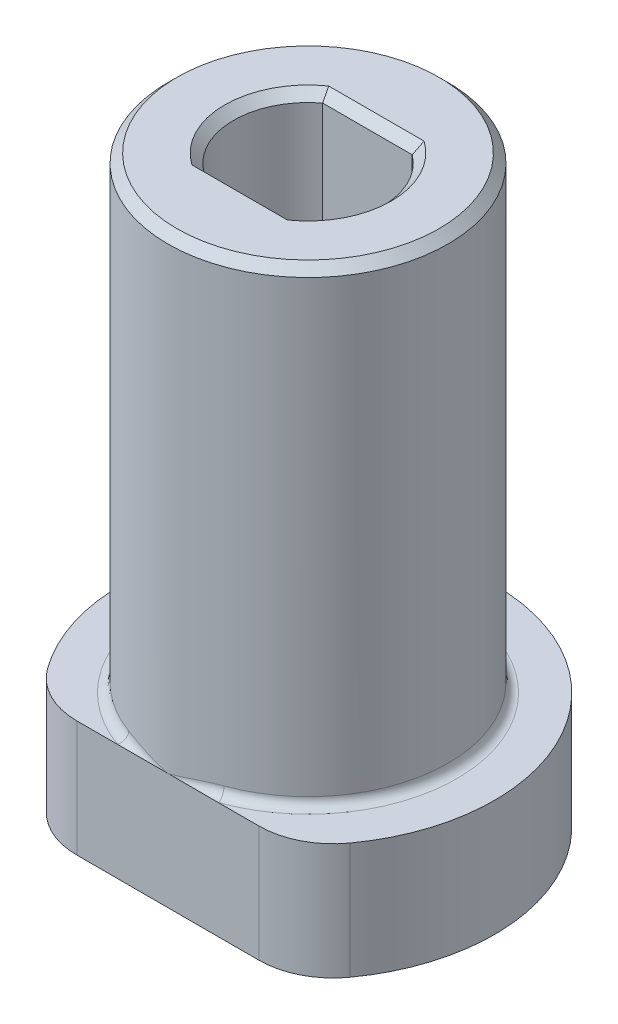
ISO-10303-21;
HEADER;
FILE_DESCRIPTION(('STEP AP214'),'2;1');
FILE_NAME('part.step','',(''),(''),'','','');
FILE_SCHEMA(('AUTOMOTIVE_DESIGN { 1 0 10303 214 1 1 1 1 }'));
ENDSEC;
DATA;
#1=APPLICATION_CONTEXT('core data for automotive mechanical design processes');
#2=APPLICATION_PROTOCOL_DEFINITION('international standard','automotive_design',2000,#1);
#3=PRODUCT_CONTEXT('',#1,'mechanical');
#4=PRODUCT('Part','Part','',(#3));
#5=PRODUCT_RELATED_PRODUCT_CATEGORY('part','',(#4));
#6=PRODUCT_DEFINITION_FORMATION('','',#4);
#7=PRODUCT_DEFINITION_CONTEXT('part definition',#1,'design');
#8=PRODUCT_DEFINITION('design','',#6,#7);
#9=PRODUCT_DEFINITION_SHAPE('','',#8);
#10=(LENGTH_UNIT() NAMED_UNIT(*) SI_UNIT(.MILLI.,.METRE.));
#11=(NAMED_UNIT(*) PLANE_ANGLE_UNIT() SI_UNIT($,.RADIAN.));
#12=(NAMED_UNIT(*) SI_UNIT($,.STERADIAN.) SOLID_ANGLE_UNIT());
#13=UNCERTAINTY_MEASURE_WITH_UNIT(LENGTH_MEASURE(1.E-05),#10,'distance_accuracy_value','');
#14=(GEOMETRIC_REPRESENTATION_CONTEXT(3) GLOBAL_UNCERTAINTY_ASSIGNED_CONTEXT((#13)) GLOBAL_UNIT_ASSIGNED_CONTEXT((#10,
#11,#12)) REPRESENTATION_CONTEXT('',''));
#15=CARTESIAN_POINT('',(0.,0.,0.));
#16=DIRECTION('',(0.,0.,1.));
#17=DIRECTION('',(1.,0.,0.));
#18=AXIS2_PLACEMENT_3D('',#15,#16,#17);
#19=CARTESIAN_POINT('',(0.,24.9936,0.));
#20=DIRECTION('',(0.,-1.,0.));
#21=DIRECTION('',(0.,0.,-1.));
#22=AXIS2_PLACEMENT_3D('',#19,#20,#21);
#23=CYLINDRICAL_SURFACE('',#22,5.99567);
#24=CARTESIAN_POINT('',(0.,24.6126,0.));
#25=DIRECTION('',(0.,1.,0.));
#26=DIRECTION('',(0.,0.,1.));
#27=AXIS2_PLACEMENT_3D('',#24,#25,#26);
#28=CIRCLE('',#27,5.99567);
#29=CARTESIAN_POINT('',(0.,24.6126,5.99567));
#30=VERTEX_POINT('',#29);
#31=EDGE_CURVE('E12',#30,#30,#28,.F.);
#32=ORIENTED_EDGE('',*,*,#31,.T.);
#33=EDGE_LOOP('',(#32));
#34=FACE_BOUND('',#33,.T.);
#35=CARTESIAN_POINT('',(-2.54980318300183,5.28632587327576,5.42646869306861));
#36=CARTESIAN_POINT('',(-2.48955629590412,5.07151106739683,5.4547776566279));
#37=CARTESIAN_POINT('',(-2.54417708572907,4.96770798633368,5.64665776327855));
#38=CARTESIAN_POINT('',(-2.59879787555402,4.86390490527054,5.8385378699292));
#39=CARTESIAN_POINT('',(-2.71183261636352,4.9784,5.99567));
#40=CARTESIAN_POINT('',(-2.5328324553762,5.29249967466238,5.43444335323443));
#41=CARTESIAN_POINT('',(-2.47686708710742,5.07926238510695,5.46051204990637));
#42=CARTESIAN_POINT('',(-2.53071149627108,4.97410558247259,5.64842878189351));
#43=CARTESIAN_POINT('',(-2.58464892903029,4.86890599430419,5.83633151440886));
#44=CARTESIAN_POINT('',(-2.69378346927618,4.9784,5.99567));
#45=CARTESIAN_POINT('',(-2.51569041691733,5.29813682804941,5.44240047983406));
#46=CARTESIAN_POINT('',(-2.46357302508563,5.08665837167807,5.46647827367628));
#47=CARTESIAN_POINT('',(-2.51670710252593,4.98030571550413,5.65053281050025));
#48=CARTESIAN_POINT('',(-2.56993249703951,4.8739154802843,5.83457198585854));
#49=CARTESIAN_POINT('',(-2.67555212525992,4.9784,5.99567));
#50=CARTESIAN_POINT('',(-2.48113264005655,5.30845859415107,5.45824144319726));
#51=CARTESIAN_POINT('',(-2.43607242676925,5.100688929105,5.47871075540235));
#52=CARTESIAN_POINT('',(-2.48782417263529,4.99226856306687,5.65527019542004));
#53=CARTESIAN_POINT('',(-2.53966544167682,4.88381087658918,5.83181533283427));
#54=CARTESIAN_POINT('',(-2.6387983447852,4.9784,5.99567));
#55=CARTESIAN_POINT('',(-2.46371706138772,5.31314374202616,5.46612531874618));
#56=CARTESIAN_POINT('',(-2.42186664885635,5.10733143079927,5.48497739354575));
#57=CARTESIAN_POINT('',(-2.47294613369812,4.99803152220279,5.65790325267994));
#58=CARTESIAN_POINT('',(-2.5241145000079,4.88869957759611,5.8308124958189));
#59=CARTESIAN_POINT('',(-2.62027607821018,4.9784,5.99567));
#60=CARTESIAN_POINT('',(-2.41122128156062,5.32594031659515,5.48958438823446));
#61=CARTESIAN_POINT('',(-2.3783667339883,5.12606545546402,5.50396956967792));
#62=CARTESIAN_POINT('',(-2.42735814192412,5.01458404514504,5.66638077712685));
#63=CARTESIAN_POINT('',(-2.47670012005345,4.90297487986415,5.82872696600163));
#64=CARTESIAN_POINT('',(-2.56444440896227,4.9784,5.99567));
#65=CARTESIAN_POINT('',(-2.37580723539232,5.33282227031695,5.50500692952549));
#66=CARTESIAN_POINT('',(-2.34786612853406,5.13714882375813,5.51703440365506));
#67=CARTESIAN_POINT('',(-2.39562554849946,5.02466938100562,5.67281373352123));
#68=CARTESIAN_POINT('',(-2.44371625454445,4.91209679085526,5.82852360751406));
#69=CARTESIAN_POINT('',(-2.52677994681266,4.9784,5.99567));
#70=CARTESIAN_POINT('',(-2.3046909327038,5.34393123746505,5.53515484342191));
#71=CARTESIAN_POINT('',(-2.28523912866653,5.15660519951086,5.5432215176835));
#72=CARTESIAN_POINT('',(-2.33063959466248,5.04291464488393,5.68651191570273));
#73=CARTESIAN_POINT('',(-2.37636397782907,4.92913328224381,5.82973366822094));
#74=CARTESIAN_POINT('',(-2.45114449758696,4.9784,5.99567));
#75=CARTESIAN_POINT('',(-2.26899348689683,5.34817975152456,5.54988492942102));
#76=CARTESIAN_POINT('',(-2.25311326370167,5.16503612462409,5.55635481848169));
#77=CARTESIAN_POINT('',(-2.29740099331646,5.0510898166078,5.69376981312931));
#78=CARTESIAN_POINT('',(-2.34198956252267,4.93707751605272,5.83111843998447));
#79=CARTESIAN_POINT('',(-2.41317862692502,4.9784,5.99567));
#80=CARTESIAN_POINT('',(-2.19715327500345,5.35457227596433,5.57871642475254));
#81=CARTESIAN_POINT('',(-2.18751899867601,5.17966637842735,5.58248690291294));
#82=CARTESIAN_POINT('',(-2.22964656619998,5.06578154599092,5.70876275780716));
#83=CARTESIAN_POINT('',(-2.27207244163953,4.95183278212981,5.83497240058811));
#84=CARTESIAN_POINT('',(-2.33677326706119,4.9784,5.99567));
#85=CARTESIAN_POINT('',(-2.16101016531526,5.35671454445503,5.59281730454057));
#86=CARTESIAN_POINT('',(-2.15402920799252,5.18589061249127,5.5954995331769));
#87=CARTESIAN_POINT('',(-2.19512970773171,5.07229672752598,5.71649819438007));
#88=CARTESIAN_POINT('',(-2.23650484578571,4.95866004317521,5.83743484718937));
#89=CARTESIAN_POINT('',(-2.29833341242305,4.9784,5.99567));
#90=CARTESIAN_POINT('',(-2.04046740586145,5.36092875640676,5.63849773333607));
#91=CARTESIAN_POINT('',(-2.04181783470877,5.20326472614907,5.63790197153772));
#92=CARTESIAN_POINT('',(-2.07900805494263,5.0914555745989,5.74248386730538));
#93=CARTESIAN_POINT('',(-2.11766521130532,4.97939863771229,5.84673875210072));
#94=CARTESIAN_POINT('',(-2.17013065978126,4.9784,5.99567));
#95=CARTESIAN_POINT('',(-1.9553715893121,5.35917193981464,5.66856856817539));
#96=CARTESIAN_POINT('',(-1.96023898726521,5.2104399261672,5.66685144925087));
#97=CARTESIAN_POINT('',(-1.99541430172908,5.10083051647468,5.7611298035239));
#98=CARTESIAN_POINT('',(-2.03179053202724,4.99112639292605,5.85515357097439));
#99=CARTESIAN_POINT('',(-2.07962735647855,4.9784,5.99567));
#100=CARTESIAN_POINT('',(-1.78423205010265,5.34914327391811,5.72474524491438));
#101=CARTESIAN_POINT('',(-1.79446551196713,5.21723388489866,5.72150414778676));
#102=CARTESIAN_POINT('',(-1.82561253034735,5.11346703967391,5.79744405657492));
#103=CARTESIAN_POINT('',(-1.85794408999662,5.00961731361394,5.87312842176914));
#104=CARTESIAN_POINT('',(-1.89761260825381,4.9784,5.99567));
#105=CARTESIAN_POINT('',(-1.69818768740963,5.34086672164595,5.75084820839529));
#106=CARTESIAN_POINT('',(-1.71004175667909,5.21696289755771,5.74733698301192));
#107=CARTESIAN_POINT('',(-1.73940266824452,5.11672420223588,5.81511165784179));
#108=CARTESIAN_POINT('',(-1.76972353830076,5.0164752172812,5.8827019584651));
#109=CARTESIAN_POINT('',(-1.80610048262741,4.9784,5.99567));
#110=CARTESIAN_POINT('',(-1.52486291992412,5.3194781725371,5.79922452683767));
#111=CARTESIAN_POINT('',(-1.53899766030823,5.21085838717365,5.79548128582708));
#112=CARTESIAN_POINT('',(-1.56472719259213,5.11858987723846,5.8486920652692));
#113=CARTESIAN_POINT('',(-1.59141922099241,5.02631112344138,5.90171763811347));
#114=CARTESIAN_POINT('',(-1.62176164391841,4.9784,5.99567));
#115=CARTESIAN_POINT('',(-1.43757808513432,5.30633034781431,5.82146766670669));
#116=CARTESIAN_POINT('',(-1.45215982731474,5.20503639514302,5.81786853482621));
#117=CARTESIAN_POINT('',(-1.47624950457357,5.11716331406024,5.86459070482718));
#118=CARTESIAN_POINT('',(-1.50110723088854,5.02931572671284,5.9111852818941));
#119=CARTESIAN_POINT('',(-1.52893021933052,4.9784,5.99567));
#120=CARTESIAN_POINT('',(-1.26259961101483,5.27647534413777,5.86190836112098));
#121=CARTESIAN_POINT('',(-1.27748293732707,5.1892434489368,5.85869577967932));
#122=CARTESIAN_POINT('',(-1.2982326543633,5.11072673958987,5.89397088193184));
#123=CARTESIAN_POINT('',(-1.31974036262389,5.03223969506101,5.9291217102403));
#124=CARTESIAN_POINT('',(-1.34283258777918,4.9784,5.99567));
#125=CARTESIAN_POINT('',(-1.17490584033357,5.25976693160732,5.88010450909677));
#126=CARTESIAN_POINT('',(-1.18946797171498,5.17928971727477,5.87721102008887));
#127=CARTESIAN_POINT('',(-1.20869313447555,5.10571548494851,5.90745157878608));
#128=CARTESIAN_POINT('',(-1.22850041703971,5.03218732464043,5.93761755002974));
#129=CARTESIAN_POINT('',(-1.24956624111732,4.9784,5.99567));
#130=CARTESIAN_POINT('',(-0.908724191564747,5.20522505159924,5.92917990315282));
#131=CARTESIAN_POINT('',(-0.922706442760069,5.14468503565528,5.92702174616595));
#132=CARTESIAN_POINT('',(-0.936283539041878,5.08652119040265,5.94417451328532));
#133=CARTESIAN_POINT('',(-0.952273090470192,5.02851716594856,5.96099424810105));
#134=CARTESIAN_POINT('',(-0.966469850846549,4.9784,5.99567));
#135=CARTESIAN_POINT('',(-0.729793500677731,5.16336476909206,5.95380718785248));
#136=CARTESIAN_POINT('',(-0.741135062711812,5.11520633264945,5.95250259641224));
#137=CARTESIAN_POINT('',(-0.752316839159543,5.06820817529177,5.96316129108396));
#138=CARTESIAN_POINT('',(-0.764671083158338,5.02132925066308,5.97373619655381));
#139=CARTESIAN_POINT('',(-0.776168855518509,4.9784,5.99567));
#140=CARTESIAN_POINT('',(-0.372077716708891,5.07506928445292,5.98680063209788));
#141=CARTESIAN_POINT('',(-0.378529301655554,5.05098210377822,5.98646171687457));
#142=CARTESIAN_POINT('',(-0.383890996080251,5.02670159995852,5.98871246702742));
#143=CARTESIAN_POINT('',(-0.390372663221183,5.00256000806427,5.99088799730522));
#144=CARTESIAN_POINT('',(-0.395721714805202,4.9784,5.99567));
#145=CARTESIAN_POINT('',(-0.193293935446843,5.02864888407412,5.99521768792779));
#146=CARTESIAN_POINT('',(-0.196379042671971,5.0160887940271,5.99520212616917));
#147=CARTESIAN_POINT('',(-0.19943522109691,5.00352356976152,5.99531574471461));
#148=CARTESIAN_POINT('',(-0.202521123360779,4.99096203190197,5.99542787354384));
#149=CARTESIAN_POINT('',(-0.205576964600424,4.9784,5.99567));
#150=CARTESIAN_POINT('',(-0.00972468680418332,4.9809281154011,5.99566407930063));
#151=CARTESIAN_POINT('',(-0.00987918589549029,4.98029608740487,5.99566392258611));
#152=CARTESIAN_POINT('',(-0.0100336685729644,4.97966405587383,5.99566538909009));
#153=CARTESIAN_POINT('',(-0.0101881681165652,4.97903202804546,5.99566689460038));
#154=CARTESIAN_POINT('',(-0.0103426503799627,4.9784,5.99567));
#155=CARTESIAN_POINT('',(-0.0048623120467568,4.97966404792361,5.99566999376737));
#156=CARTESIAN_POINT('',(-0.00493955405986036,4.97934803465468,5.99567002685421));
#157=CARTESIAN_POINT('',(-0.00501680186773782,4.97903202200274,5.99567001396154));
#158=CARTESIAN_POINT('',(-0.00509404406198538,4.97871601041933,5.99567004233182));
#159=CARTESIAN_POINT('',(-0.00517129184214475,4.9784,5.99567));
#160=CARTESIAN_POINT('',(0.,4.9784,5.99567));
#161=CARTESIAN_POINT('',(0.,4.9784,5.99567));
#162=CARTESIAN_POINT('',(0.,4.9784,5.99567));
#163=CARTESIAN_POINT('',(0.,4.9784,5.99567));
#164=CARTESIAN_POINT('',(0.,4.9784,5.99567));
#165=(BOUNDED_SURFACE() B_SPLINE_SURFACE(3,2,((#35,#36,#37,#38,#39),(#40,#41,#42,#43,#44),(#45,
#46,#47,#48,#49),(#50,#51,#52,#53,#54),(#55,#56,#57,#58,#59),(#60,#61,#62,#63,#64),(#65,#66,#67,
#68,#69),(#70,#71,#72,#73,#74),(#75,#76,#77,#78,#79),(#80,#81,#82,#83,#84),(#85,#86,#87,#88,
#89),(#90,#91,#92,#93,#94),(#95,#96,#97,#98,#99),(#100,#101,#102,#103,#104),(#105,#106,#107,
#108,#109),(#110,#111,#112,#113,#114),(#115,#116,#117,#118,#119),(#120,#121,#122,#123,#124),
(#125,#126,#127,#128,#129),(#130,#131,#132,#133,#134),(#135,#136,#137,#138,#139),(#140,#141,
#142,#143,#144),(#145,#146,#147,#148,#149),(#150,#151,#152,#153,#154),(#155,#156,#157,#158,
#159),(#160,#161,#162,#163,#164)),.UNSPECIFIED.,.F.,.F.,.F.) B_SPLINE_SURFACE_WITH_KNOTS((4,2,2,
2,2,2,2,2,2,2,2,2,4),(3,2,3),(0.,0.0626078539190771,0.1251804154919,0.250014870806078,
0.373816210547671,0.497719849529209,0.785246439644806,1.07298062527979,1.36287450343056,
1.65286897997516,2.24168937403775,2.82865797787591,2.84462879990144),(0.,0.5,1.),
.UNSPECIFIED.) GEOMETRIC_REPRESENTATION_ITEM() RATIONAL_B_SPLINE_SURFACE(((1.,0.861168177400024,
1.,0.861168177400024,1.),(1.,0.864075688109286,1.,0.864075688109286,1.),(1.,0.86688678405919,1.,
0.86688678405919,1.),(1.,0.8723313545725,1.,0.8723313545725,1.),(1.,0.874964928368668,1.,
0.874964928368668,1.),(1.,0.882614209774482,1.,0.882614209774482,1.),(1.,0.887392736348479,1.,
0.887392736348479,1.),(1.,0.896384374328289,1.,0.896384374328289,1.),(1.,0.900601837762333,1.,
0.900601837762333,1.),(1.,0.908601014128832,1.,0.908601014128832,1.),(1.,0.912382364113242,1.,
0.912382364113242,1.),(1.,0.924319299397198,1.,0.924319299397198,1.),(1.,0.931657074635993,1.,
0.931657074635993,1.),(1.,0.944837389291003,1.,0.944837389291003,1.),(1.,0.950678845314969,1.,
0.950678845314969,1.),(1.,0.961199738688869,1.,0.961199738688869,1.),(1.,0.965870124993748,1.,
0.965870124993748,1.),(1.,0.974185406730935,1.,0.974185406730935,1.),(1.,0.977829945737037,1.,
0.977829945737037,1.),(1.,0.987522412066,1.,0.987522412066,1.),(1.,0.992177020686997,1.,
0.992177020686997,1.),(1.,0.99836924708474,1.,0.99836924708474,1.),(1.,0.999916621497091,1.,
0.999916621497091,1.),(1.,0.999998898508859,1.,0.999998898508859,1.),(1.,0.999999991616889,1.,
0.999999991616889,1.),(1.,1.,1.,1.,1.))) REPRESENTATION_ITEM('') SURFACE());
#166=CARTESIAN_POINT('',(-2.54980318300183,5.28632587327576,5.42646869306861));
#167=CARTESIAN_POINT('',(-2.5328324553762,5.29249967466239,5.43444335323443));
#168=CARTESIAN_POINT('',(-2.51569041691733,5.29813682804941,5.44240047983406));
#169=CARTESIAN_POINT('',(-2.48113264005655,5.30845859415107,5.45824144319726));
#170=CARTESIAN_POINT('',(-2.46371706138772,5.31314374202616,5.46612531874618));
#171=CARTESIAN_POINT('',(-2.41122128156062,5.32594031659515,5.48958438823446));
#172=CARTESIAN_POINT('',(-2.37580723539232,5.33282227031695,5.50500692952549));
#173=CARTESIAN_POINT('',(-2.3046909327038,5.34393123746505,5.53515484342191));
#174=CARTESIAN_POINT('',(-2.26899348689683,5.34817975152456,5.54988492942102));
#175=CARTESIAN_POINT('',(-2.19715327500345,5.35457227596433,5.57871642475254));
#176=CARTESIAN_POINT('',(-2.16101016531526,5.35671454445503,5.59281730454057));
#177=CARTESIAN_POINT('',(-2.04046740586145,5.36092875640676,5.63849773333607));
#178=CARTESIAN_POINT('',(-1.9553715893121,5.35917193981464,5.66856856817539));
#179=CARTESIAN_POINT('',(-1.78423205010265,5.34914327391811,5.72474524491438));
#180=CARTESIAN_POINT('',(-1.69818768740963,5.34086672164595,5.75084820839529));
#181=CARTESIAN_POINT('',(-1.52486291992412,5.3194781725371,5.79922452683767));
#182=CARTESIAN_POINT('',(-1.43757808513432,5.30633034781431,5.82146766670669));
#183=CARTESIAN_POINT('',(-1.26259961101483,5.27647534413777,5.86190836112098));
#184=CARTESIAN_POINT('',(-1.17490584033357,5.25976693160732,5.88010450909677));
#185=CARTESIAN_POINT('',(-0.908724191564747,5.20522505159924,5.92917990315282));
#186=CARTESIAN_POINT('',(-0.729793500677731,5.16336476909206,5.95380718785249));
#187=CARTESIAN_POINT('',(-0.37207771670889,5.07506928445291,5.98680063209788));
#188=CARTESIAN_POINT('',(-0.193293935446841,5.02864888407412,5.99521768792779));
#189=CARTESIAN_POINT('',(-0.00972468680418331,4.9809281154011,5.99566407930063));
#190=CARTESIAN_POINT('',(-0.0048623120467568,4.97966404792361,5.99566999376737));
#191=CARTESIAN_POINT('',(0.,4.9784,5.99567));
#192=B_SPLINE_CURVE_WITH_KNOTS('',3,(#166,#167,#168,#169,#170,#171,#172,#173,#174,#175,#176,
#177,#178,#179,#180,#181,#182,#183,#184,#185,#186,#187,#188,#189,#190,#191),.UNSPECIFIED.,.F.,
.F.,(4,2,2,2,2,2,2,2,2,2,2,2,4),(0.,0.0626078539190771,0.1251804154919,0.250014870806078,
0.373816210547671,0.497719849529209,0.785246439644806,1.07298062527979,1.36287450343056,
1.65286897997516,2.24168937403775,2.82865797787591,2.84462879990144),.UNSPECIFIED.);
#193=CARTESIAN_POINT('',(-2.04141917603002,5.3594,5.63743438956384));
#194=VERTEX_POINT('',#193);
#195=CARTESIAN_POINT('',(0.,4.9784,5.99567));
#196=VERTEX_POINT('',#195);
#197=EDGE_CURVE('E142',#194,#196,#192,.T.);
#198=ORIENTED_EDGE('',*,*,#197,.T.);
#199=CARTESIAN_POINT('',(2.7118326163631,4.9784,5.99567));
#200=CARTESIAN_POINT('',(2.59879787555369,4.86390490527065,5.83853786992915));
#201=CARTESIAN_POINT('',(2.54417708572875,4.96770798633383,5.64665776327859));
#202=CARTESIAN_POINT('',(2.48955629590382,5.07151106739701,5.45477765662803));
#203=CARTESIAN_POINT('',(2.54980318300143,5.2863258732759,5.4264686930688));
#204=CARTESIAN_POINT('',(2.69378346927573,4.9784,5.99567));
#205=CARTESIAN_POINT('',(2.58464892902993,4.86890599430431,5.83633151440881));
#206=CARTESIAN_POINT('',(2.53071149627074,4.97410558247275,5.64842878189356));
#207=CARTESIAN_POINT('',(2.4768670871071,5.07926238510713,5.46051204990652));
#208=CARTESIAN_POINT('',(2.53283245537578,5.29249967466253,5.43444335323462));
#209=CARTESIAN_POINT('',(2.67555212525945,4.9784,5.99567));
#210=CARTESIAN_POINT('',(2.56993249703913,4.87391548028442,5.8345719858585));
#211=CARTESIAN_POINT('',(2.51670710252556,4.98030571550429,5.65053281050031));
#212=CARTESIAN_POINT('',(2.46357302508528,5.08665837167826,5.46647827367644));
#213=CARTESIAN_POINT('',(2.51569041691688,5.29813682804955,5.44240047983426));
#214=CARTESIAN_POINT('',(2.63879834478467,4.9784,5.99567));
#215=CARTESIAN_POINT('',(2.53966544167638,4.88381087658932,5.83181533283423));
#216=CARTESIAN_POINT('',(2.48782417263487,4.99226856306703,5.65527019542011));
#217=CARTESIAN_POINT('',(2.43607242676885,5.10068892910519,5.47871075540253));
#218=CARTESIAN_POINT('',(2.48113264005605,5.30845859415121,5.45824144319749));
#219=CARTESIAN_POINT('',(2.62027607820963,4.9784,5.99567));
#220=CARTESIAN_POINT('',(2.52411450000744,4.88869957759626,5.83081249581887));
#221=CARTESIAN_POINT('',(2.47294613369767,4.99803152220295,5.65790325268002));
#222=CARTESIAN_POINT('',(2.42186664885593,5.10733143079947,5.48497739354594));
#223=CARTESIAN_POINT('',(2.4637170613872,5.31314374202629,5.46612531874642));
#224=CARTESIAN_POINT('',(2.56444440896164,4.9784,5.99567));
#225=CARTESIAN_POINT('',(2.47670012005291,4.90297487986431,5.82872696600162));
#226=CARTESIAN_POINT('',(2.4273581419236,5.01458404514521,5.66638077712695));
#227=CARTESIAN_POINT('',(2.3783667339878,5.12606545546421,5.50396956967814));
#228=CARTESIAN_POINT('',(2.41122128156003,5.32594031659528,5.48958438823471));
#229=CARTESIAN_POINT('',(2.52677994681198,4.9784,5.99567));
#230=CARTESIAN_POINT('',(2.44371625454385,4.91209679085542,5.82852360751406));
#231=CARTESIAN_POINT('',(2.39562554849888,5.0246693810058,5.67281373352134));
#232=CARTESIAN_POINT('',(2.3478661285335,5.13714882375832,5.5170344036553));
#233=CARTESIAN_POINT('',(2.37580723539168,5.33282227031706,5.50500692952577));
#234=CARTESIAN_POINT('',(2.45114449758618,4.9784,5.99567));
#235=CARTESIAN_POINT('',(2.37636397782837,4.92913328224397,5.82973366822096));
#236=CARTESIAN_POINT('',(2.3306395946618,5.0429146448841,5.68651191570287));
#237=CARTESIAN_POINT('',(2.28523912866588,5.15660519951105,5.54322151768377));
#238=CARTESIAN_POINT('',(2.30469093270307,5.34393123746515,5.53515484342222));
#239=CARTESIAN_POINT('',(2.41317862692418,4.9784,5.99567));
#240=CARTESIAN_POINT('',(2.34198956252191,4.9370775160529,5.8311184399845));
#241=CARTESIAN_POINT('',(2.29740099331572,5.05108981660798,5.69376981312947));
#242=CARTESIAN_POINT('',(2.25311326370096,5.16503612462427,5.55635481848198));
#243=CARTESIAN_POINT('',(2.26899348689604,5.34817975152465,5.54988492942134));
#244=CARTESIAN_POINT('',(2.33677326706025,4.9784,5.99567));
#245=CARTESIAN_POINT('',(2.27207244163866,4.95183278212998,5.83497240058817));
#246=CARTESIAN_POINT('',(2.22964656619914,5.06578154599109,5.70876275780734));
#247=CARTESIAN_POINT('',(2.1875189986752,5.17966637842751,5.58248690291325));
#248=CARTESIAN_POINT('',(2.19715327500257,5.35457227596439,5.57871642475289));
#249=CARTESIAN_POINT('',(2.29833341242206,4.9784,5.99567));
#250=CARTESIAN_POINT('',(2.23650484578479,4.95866004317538,5.83743484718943));
#251=CARTESIAN_POINT('',(2.19512970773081,5.07229672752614,5.71649819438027));
#252=CARTESIAN_POINT('',(2.15402920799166,5.18589061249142,5.59549953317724));
#253=CARTESIAN_POINT('',(2.16101016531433,5.35671454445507,5.59281730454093));
#254=CARTESIAN_POINT('',(2.1701306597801,4.9784,5.99567));
#255=CARTESIAN_POINT('',(2.11766521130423,4.97939863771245,5.84673875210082));
#256=CARTESIAN_POINT('',(2.07900805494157,5.09145557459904,5.74248386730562));
#257=CARTESIAN_POINT('',(2.04181783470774,5.20326472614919,5.6379019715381));
#258=CARTESIAN_POINT('',(2.04046740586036,5.36092875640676,5.63849773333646));
#259=CARTESIAN_POINT('',(2.07962735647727,4.9784,5.99567));
#260=CARTESIAN_POINT('',(2.03179053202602,4.9911263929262,5.85515357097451));
#261=CARTESIAN_POINT('',(1.99541430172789,5.1008305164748,5.76112980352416));
#262=CARTESIAN_POINT('',(1.96023898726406,5.21043992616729,5.66685144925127));
#263=CARTESIAN_POINT('',(1.9553715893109,5.35917193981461,5.6685685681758));
#264=CARTESIAN_POINT('',(1.89761260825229,4.9784,5.99567));
#265=CARTESIAN_POINT('',(1.85794408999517,5.00961731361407,5.87312842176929));
#266=CARTESIAN_POINT('',(1.82561253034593,5.11346703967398,5.79744405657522));
#267=CARTESIAN_POINT('',(1.79446551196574,5.21723388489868,5.72150414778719));
#268=CARTESIAN_POINT('',(1.78423205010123,5.349143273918,5.72474524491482));
#269=CARTESIAN_POINT('',(1.80610048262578,4.9784,5.99567));
#270=CARTESIAN_POINT('',(1.76972353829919,5.01647521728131,5.88270195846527));
#271=CARTESIAN_POINT('',(1.73940266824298,5.11672420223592,5.8151116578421));
#272=CARTESIAN_POINT('',(1.71004175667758,5.21696289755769,5.74733698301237));
#273=CARTESIAN_POINT('',(1.6981876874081,5.34086672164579,5.75084820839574));
#274=CARTESIAN_POINT('',(1.62176164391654,4.9784,5.99567));
#275=CARTESIAN_POINT('',(1.5914192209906,5.02631112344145,5.90171763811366));
#276=CARTESIAN_POINT('',(1.56472719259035,5.11858987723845,5.84869206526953));
#277=CARTESIAN_POINT('',(1.5389976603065,5.21085838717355,5.79548128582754));
#278=CARTESIAN_POINT('',(1.52486291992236,5.31947817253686,5.79922452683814));
#279=CARTESIAN_POINT('',(1.52893021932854,4.9784,5.99567));
#280=CARTESIAN_POINT('',(1.50110723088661,5.02931572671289,5.9111852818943));
#281=CARTESIAN_POINT('',(1.47624950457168,5.1171633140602,5.86459070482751));
#282=CARTESIAN_POINT('',(1.45215982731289,5.20503639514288,5.81786853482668));
#283=CARTESIAN_POINT('',(1.43757808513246,5.30633034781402,5.82146766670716));
#284=CARTESIAN_POINT('',(1.34283258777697,4.9784,5.99567));
#285=CARTESIAN_POINT('',(1.31974036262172,5.03223969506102,5.9291217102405));
#286=CARTESIAN_POINT('',(1.29823265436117,5.11072673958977,5.89397088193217));
#287=CARTESIAN_POINT('',(1.27748293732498,5.18924344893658,5.85869577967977));
#288=CARTESIAN_POINT('',(1.26259961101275,5.27647534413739,5.86190836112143));
#289=CARTESIAN_POINT('',(1.24956624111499,4.9784,5.99567));
#290=CARTESIAN_POINT('',(1.22850041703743,5.03218732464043,5.93761755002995));
#291=CARTESIAN_POINT('',(1.20869313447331,5.10571548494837,5.9074515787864));
#292=CARTESIAN_POINT('',(1.18946797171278,5.17928971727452,5.87721102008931));
#293=CARTESIAN_POINT('',(1.17490584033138,5.25976693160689,5.88010450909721));
#294=CARTESIAN_POINT('',(0.966469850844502,4.9784,5.99567));
#295=CARTESIAN_POINT('',(0.952273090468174,5.0285171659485,5.9609942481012));
#296=CARTESIAN_POINT('',(0.9362835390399,5.08652119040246,5.94417451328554));
#297=CARTESIAN_POINT('',(0.922706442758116,5.14468503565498,5.92702174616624));
#298=CARTESIAN_POINT('',(0.908724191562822,5.2052250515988,5.9291799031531));
#299=CARTESIAN_POINT('',(0.776168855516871,4.9784,5.99567));
#300=CARTESIAN_POINT('',(0.764671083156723,5.02132925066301,5.97373619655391));
#301=CARTESIAN_POINT('',(0.752316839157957,5.0682081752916,5.9631612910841));
#302=CARTESIAN_POINT('',(0.741135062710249,5.11520633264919,5.95250259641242));
#303=CARTESIAN_POINT('',(0.72979350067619,5.1633647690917,5.95380718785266));
#304=CARTESIAN_POINT('',(0.39572171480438,4.9784,5.99567));
#305=CARTESIAN_POINT('',(0.390372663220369,5.00256000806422,5.99088799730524));
#306=CARTESIAN_POINT('',(0.383890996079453,5.02670159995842,5.98871246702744));
#307=CARTESIAN_POINT('',(0.378529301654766,5.05098210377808,5.98646171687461));
#308=CARTESIAN_POINT('',(0.372077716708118,5.07506928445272,5.98680063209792));
#309=CARTESIAN_POINT('',(0.205576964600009,4.9784,5.99567));
#310=CARTESIAN_POINT('',(0.20252112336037,4.99096203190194,5.99542787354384));
#311=CARTESIAN_POINT('',(0.199435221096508,5.00352356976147,5.99531574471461));
#312=CARTESIAN_POINT('',(0.196379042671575,5.01608879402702,5.99520212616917));
#313=CARTESIAN_POINT('',(0.193293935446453,5.02864888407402,5.99521768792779));
#314=CARTESIAN_POINT('',(0.0103426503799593,4.9784,5.99567));
#315=CARTESIAN_POINT('',(0.0101881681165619,4.97903202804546,5.99566689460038));
#316=CARTESIAN_POINT('',(0.010033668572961,4.97966405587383,5.99566538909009));
#317=CARTESIAN_POINT('',(0.0098791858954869,4.98029608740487,5.99566392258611));
#318=CARTESIAN_POINT('',(0.00972468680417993,4.9809281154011,5.99566407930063));
#319=CARTESIAN_POINT('',(0.00517129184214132,4.9784,5.99567));
#320=CARTESIAN_POINT('',(0.00509404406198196,4.97871601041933,5.99567004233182));
#321=CARTESIAN_POINT('',(0.00501680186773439,4.97903202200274,5.99567001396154));
#322=CARTESIAN_POINT('',(0.00493955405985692,4.97934803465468,5.99567002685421));
#323=CARTESIAN_POINT('',(0.00486231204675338,4.97966404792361,5.99566999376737));
#324=CARTESIAN_POINT('',(0.,4.9784,5.99567));
#325=CARTESIAN_POINT('',(0.,4.9784,5.99567));
#326=CARTESIAN_POINT('',(0.,4.9784,5.99567));
#327=CARTESIAN_POINT('',(0.,4.9784,5.99567));
#328=CARTESIAN_POINT('',(0.,4.9784,5.99567));
#329=(BOUNDED_SURFACE() B_SPLINE_SURFACE(3,2,((#199,#200,#201,#202,#203),(#204,#205,#206,#207,
#208),(#209,#210,#211,#212,#213),(#214,#215,#216,#217,#218),(#219,#220,#221,#222,#223),(#224,
#225,#226,#227,#228),(#229,#230,#231,#232,#233),(#234,#235,#236,#237,#238),(#239,#240,#241,#242,
#243),(#244,#245,#246,#247,#248),(#249,#250,#251,#252,#253),(#254,#255,#256,#257,#258),(#259,
#260,#261,#262,#263),(#264,#265,#266,#267,#268),(#269,#270,#271,#272,#273),(#274,#275,#276,#277,
#278),(#279,#280,#281,#282,#283),(#284,#285,#286,#287,#288),(#289,#290,#291,#292,#293),(#294,
#295,#296,#297,#298),(#299,#300,#301,#302,#303),(#304,#305,#306,#307,#308),(#309,#310,#311,#312,
#313),(#314,#315,#316,#317,#318),(#319,#320,#321,#322,#323),(#324,#325,#326,#327,#328)),
.UNSPECIFIED.,.F.,.F.,.F.) B_SPLINE_SURFACE_WITH_KNOTS((4,2,2,2,2,2,2,2,2,2,2,2,4),(3,2,3),(0.,
0.0626078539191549,0.125180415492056,0.25001487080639,0.373816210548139,0.497719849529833,
0.785246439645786,1.07298062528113,1.36287450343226,1.65286897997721,2.24168937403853,
2.82865797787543,2.84462879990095),(0.,0.5,1.),
.UNSPECIFIED.) GEOMETRIC_REPRESENTATION_ITEM() RATIONAL_B_SPLINE_SURFACE(((1.,0.861168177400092,
1.,0.861168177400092,1.),(1.,0.864075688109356,1.,0.864075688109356,1.),(1.,0.866886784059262,
1.,0.866886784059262,1.),(1.,0.872331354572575,1.,0.872331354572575,1.),(1.,0.874964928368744,
1.,0.874964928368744,1.),(1.,0.882614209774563,1.,0.882614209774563,1.),(1.,0.887392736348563,
1.,0.887392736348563,1.),(1.,0.896384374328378,1.,0.896384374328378,1.),(1.,0.900601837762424,
1.,0.900601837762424,1.),(1.,0.908601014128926,1.,0.908601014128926,1.),(1.,0.912382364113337,
1.,0.912382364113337,1.),(1.,0.924319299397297,1.,0.924319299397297,1.),(1.,0.931657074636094,
1.,0.931657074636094,1.),(1.,0.944837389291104,1.,0.944837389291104,1.),(1.,0.950678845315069,
1.,0.950678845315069,1.),(1.,0.961199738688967,1.,0.961199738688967,1.),(1.,0.965870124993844,
1.,0.965870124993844,1.),(1.,0.974185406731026,1.,0.974185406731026,1.),(1.,0.977829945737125,
1.,0.977829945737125,1.),(1.,0.987522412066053,1.,0.987522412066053,1.),(1.,0.99217702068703,1.,
0.99217702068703,1.),(1.,0.998369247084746,1.,0.998369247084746,1.),(1.,0.999916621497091,1.,
0.999916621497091,1.),(1.,0.999998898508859,1.,0.999998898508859,1.),(1.,0.999999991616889,1.,
0.999999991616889,1.),(1.,1.,1.,1.,1.))) REPRESENTATION_ITEM('') SURFACE());
#330=CARTESIAN_POINT('',(2.54980318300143,5.2863258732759,5.4264686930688));
#331=CARTESIAN_POINT('',(2.53283245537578,5.29249967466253,5.43444335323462));
#332=CARTESIAN_POINT('',(2.51569041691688,5.29813682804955,5.44240047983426));
#333=CARTESIAN_POINT('',(2.48113264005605,5.30845859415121,5.45824144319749));
#334=CARTESIAN_POINT('',(2.4637170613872,5.31314374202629,5.46612531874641));
#335=CARTESIAN_POINT('',(2.41122128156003,5.32594031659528,5.48958438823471));
#336=CARTESIAN_POINT('',(2.37580723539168,5.33282227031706,5.50500692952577));
#337=CARTESIAN_POINT('',(2.30469093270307,5.34393123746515,5.53515484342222));
#338=CARTESIAN_POINT('',(2.26899348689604,5.34817975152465,5.54988492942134));
#339=CARTESIAN_POINT('',(2.19715327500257,5.35457227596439,5.57871642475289));
#340=CARTESIAN_POINT('',(2.16101016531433,5.35671454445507,5.59281730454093));
#341=CARTESIAN_POINT('',(2.04046740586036,5.36092875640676,5.63849773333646));
#342=CARTESIAN_POINT('',(1.9553715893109,5.35917193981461,5.6685685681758));
#343=CARTESIAN_POINT('',(1.78423205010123,5.34914327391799,5.72474524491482));
#344=CARTESIAN_POINT('',(1.6981876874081,5.34086672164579,5.75084820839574));
#345=CARTESIAN_POINT('',(1.52486291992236,5.31947817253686,5.79922452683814));
#346=CARTESIAN_POINT('',(1.43757808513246,5.30633034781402,5.82146766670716));
#347=CARTESIAN_POINT('',(1.26259961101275,5.27647534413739,5.86190836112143));
#348=CARTESIAN_POINT('',(1.17490584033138,5.25976693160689,5.88010450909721));
#349=CARTESIAN_POINT('',(0.908724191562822,5.2052250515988,5.9291799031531));
#350=CARTESIAN_POINT('',(0.729793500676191,5.1633647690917,5.95380718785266));
#351=CARTESIAN_POINT('',(0.372077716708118,5.07506928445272,5.98680063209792));
#352=CARTESIAN_POINT('',(0.193293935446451,5.02864888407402,5.99521768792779));
#353=CARTESIAN_POINT('',(0.00972468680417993,4.9809281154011,5.99566407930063));
#354=CARTESIAN_POINT('',(0.00486231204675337,4.97966404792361,5.99566999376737));
#355=CARTESIAN_POINT('',(0.,4.9784,5.99567));
#356=B_SPLINE_CURVE_WITH_KNOTS('',3,(#330,#331,#332,#333,#334,#335,#336,#337,#338,#339,#340,
#341,#342,#343,#344,#345,#346,#347,#348,#349,#350,#351,#352,#353,#354,#355),.UNSPECIFIED.,.F.,
.F.,(4,2,2,2,2,2,2,2,2,2,2,2,4),(0.,0.0626078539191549,0.125180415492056,0.25001487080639,
0.373816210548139,0.497719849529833,0.785246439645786,1.07298062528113,1.36287450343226,
1.65286897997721,2.24168937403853,2.82865797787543,2.84462879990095),.UNSPECIFIED.);
#357=CARTESIAN_POINT('',(2.04141917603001,5.3594,5.63743438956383));
#358=VERTEX_POINT('',#357);
#359=EDGE_CURVE('E145',#196,#358,#356,.F.);
#360=ORIENTED_EDGE('',*,*,#359,.T.);
#361=CARTESIAN_POINT('',(0.,5.3594,0.));
#362=DIRECTION('',(0.,-1.,0.));
#363=DIRECTION('',(0.,0.,-1.));
#364=AXIS2_PLACEMENT_3D('',#361,#362,#363);
#365=CIRCLE('',#364,5.99567);
#366=EDGE_CURVE('E148',#358,#194,#365,.F.);
#367=ORIENTED_EDGE('',*,*,#366,.T.);
#368=EDGE_LOOP('',(#198,#360,#367));
#369=FACE_BOUND('',#368,.T.);
#370=ADVANCED_FACE('F36',(#34,#369),#23,.T.);
#371=CARTESIAN_POINT('',(0.,24.9936,0.));
#372=DIRECTION('',(0.,1.,0.));
#373=DIRECTION('',(0.,0.,1.));
#374=AXIS2_PLACEMENT_3D('',#371,#372,#373);
#375=PLANE('',#374);
#376=CARTESIAN_POINT('',(0.,24.9936,0.));
#377=DIRECTION('',(0.,1.,0.));
#378=DIRECTION('',(0.,0.,1.));
#379=AXIS2_PLACEMENT_3D('',#376,#377,#378);
#380=CIRCLE('',#379,5.61467000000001);
#381=CARTESIAN_POINT('',(0.,24.9936,5.61467000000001));
#382=VERTEX_POINT('',#381);
#383=EDGE_CURVE('E44',#382,#382,#380,.T.);
#384=ORIENTED_EDGE('',*,*,#383,.T.);
#385=EDGE_LOOP('',(#384));
#386=FACE_BOUND('',#385,.T.);
#387=DIRECTION('',(1.,0.,0.));
#388=VECTOR('',#387,1.);
#389=CARTESIAN_POINT('',(1.91768948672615,24.9936,-2.92735));
#390=LINE('',#389,#388);
#391=CARTESIAN_POINT('',(-2.04113734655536,24.9936,-2.92735));
#392=VERTEX_POINT('',#391);
#393=CARTESIAN_POINT('',(2.04113734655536,24.9936,-2.92735));
#394=VERTEX_POINT('',#393);
#395=EDGE_CURVE('E389',#392,#394,#390,.T.);
#396=ORIENTED_EDGE('',*,*,#395,.T.);
#397=CARTESIAN_POINT('',(0.,24.9936,0.));
#398=DIRECTION('',(0.,1.,0.));
#399=DIRECTION('',(0.,0.,1.));
#400=AXIS2_PLACEMENT_3D('',#397,#398,#399);
#401=CIRCLE('',#400,3.5687);
#402=CARTESIAN_POINT('',(2.04113734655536,24.9936,2.92735));
#403=VERTEX_POINT('',#402);
#404=EDGE_CURVE('E382',#394,#403,#401,.F.);
#405=ORIENTED_EDGE('',*,*,#404,.T.);
#406=DIRECTION('',(-1.,0.,0.));
#407=VECTOR('',#406,1.);
#408=CARTESIAN_POINT('',(-1.91768948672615,24.9936,2.92735));
#409=LINE('',#408,#407);
#410=CARTESIAN_POINT('',(-2.04113734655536,24.9936,2.92734999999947));
#411=VERTEX_POINT('',#410);
#412=EDGE_CURVE('E385',#403,#411,#409,.T.);
#413=ORIENTED_EDGE('',*,*,#412,.T.);
#414=CARTESIAN_POINT('',(0.,24.9936,0.));
#415=DIRECTION('',(0.,1.,0.));
#416=DIRECTION('',(0.,0.,1.));
#417=AXIS2_PLACEMENT_3D('',#414,#415,#416);
#418=CIRCLE('',#417,3.5687);
#419=EDGE_CURVE('E387',#411,#392,#418,.F.);
#420=ORIENTED_EDGE('',*,*,#419,.T.);
#421=EDGE_LOOP('',(#396,#405,#413,#420));
#422=FACE_BOUND('',#421,.T.);
#423=ADVANCED_FACE('F348',(#386,#422),#375,.T.);
#424=CARTESIAN_POINT('',(0.,4.9784,0.));
#425=DIRECTION('',(0.,-1.,0.));
#426=DIRECTION('',(0.,0.,-1.));
#427=AXIS2_PLACEMENT_3D('',#424,#425,#426);
#428=PLANE('',#427);
#429=DIRECTION('',(-1.,0.,0.));
#430=VECTOR('',#429,1.);
#431=CARTESIAN_POINT('',(-5.27871936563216,4.9784,5.99567));
#432=LINE('',#431,#430);
#433=CARTESIAN_POINT('',(3.90021507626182,4.9784,5.99567));
#434=VERTEX_POINT('',#433);
#435=CARTESIAN_POINT('',(2.17114291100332,4.9784,5.99567));
#436=VERTEX_POINT('',#435);
#437=EDGE_CURVE('E164',#434,#436,#432,.T.);
#438=ORIENTED_EDGE('',*,*,#437,.F.);
#439=CARTESIAN_POINT('',(3.90021507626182,4.9784,2.82067));
#440=DIRECTION('',(0.,-1.,0.));
#441=DIRECTION('',(0.,0.,-1.));
#442=AXIS2_PLACEMENT_3D('',#439,#440,#441);
#443=CIRCLE('',#442,3.175);
#444=CARTESIAN_POINT('',(6.47291631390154,4.9784,4.68127026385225));
#445=VERTEX_POINT('',#444);
#446=EDGE_CURVE('E152',#434,#445,#443,.F.);
#447=ORIENTED_EDGE('',*,*,#446,.T.);
#448=CARTESIAN_POINT('',(0.,4.9784,0.));
#449=DIRECTION('',(0.,-1.,0.));
#450=DIRECTION('',(0.,0.,-1.));
#451=AXIS2_PLACEMENT_3D('',#448,#449,#450);
#452=CIRCLE('',#451,7.9883);
#453=CARTESIAN_POINT('',(-6.47291631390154,4.9784,4.68127026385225));
#454=VERTEX_POINT('',#453);
#455=EDGE_CURVE('E176',#454,#445,#452,.T.);
#456=ORIENTED_EDGE('',*,*,#455,.F.);
#457=CARTESIAN_POINT('',(-3.90021507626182,4.9784,2.82067));
#458=DIRECTION('',(0.,-1.,0.));
#459=DIRECTION('',(0.,0.,-1.));
#460=AXIS2_PLACEMENT_3D('',#457,#458,#459);
#461=CIRCLE('',#460,3.175);
#462=CARTESIAN_POINT('',(-3.90021507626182,4.9784,5.99567));
#463=VERTEX_POINT('',#462);
#464=EDGE_CURVE('E203',#454,#463,#461,.F.);
#465=ORIENTED_EDGE('',*,*,#464,.T.);
#466=CARTESIAN_POINT('',(-2.17114291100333,4.9784,5.99567));
#467=VERTEX_POINT('',#466);
#468=EDGE_CURVE('E168',#467,#463,#432,.T.);
#469=ORIENTED_EDGE('',*,*,#468,.F.);
#470=CARTESIAN_POINT('',(0.,4.9784,0.));
#471=DIRECTION('',(0.,-1.,0.));
#472=DIRECTION('',(0.,0.,-1.));
#473=AXIS2_PLACEMENT_3D('',#470,#471,#472);
#474=CIRCLE('',#473,6.37667);
#475=EDGE_CURVE('E201',#467,#436,#474,.T.);
#476=ORIENTED_EDGE('',*,*,#475,.T.);
#477=EDGE_LOOP('',(#438,#447,#456,#465,#469,#476));
#478=FACE_BOUND('',#477,.T.);
#479=ADVANCED_FACE('F353',(#478),#428,.F.);
#480=CARTESIAN_POINT('',(-5.27871936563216,4.9784,5.99567));
#481=DIRECTION('',(0.,0.,1.));
#482=DIRECTION('',(1.,0.,0.));
#483=AXIS2_PLACEMENT_3D('',#480,#481,#482);
#484=PLANE('',#483);
#485=DIRECTION('',(-1.,0.,0.));
#486=VECTOR('',#485,1.);
#487=CARTESIAN_POINT('',(-5.27871936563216,0.,5.99567));
#488=LINE('',#487,#486);
#489=CARTESIAN_POINT('',(3.90021507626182,0.,5.99567));
#490=VERTEX_POINT('',#489);
#491=CARTESIAN_POINT('',(-3.90021507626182,0.,5.99567));
#492=VERTEX_POINT('',#491);
#493=EDGE_CURVE('E191',#490,#492,#488,.T.);
#494=ORIENTED_EDGE('',*,*,#493,.F.);
#495=DIRECTION('',(0.,-1.,0.));
#496=VECTOR('',#495,1.);
#497=CARTESIAN_POINT('',(3.90021507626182,4.9784,5.99567));
#498=LINE('',#497,#496);
#499=EDGE_CURVE('E199',#490,#434,#498,.F.);
#500=ORIENTED_EDGE('',*,*,#499,.T.);
#501=ORIENTED_EDGE('',*,*,#437,.T.);
#502=EDGE_CURVE('E158',#436,#196,#432,.T.);
#503=ORIENTED_EDGE('',*,*,#502,.T.);
#504=EDGE_CURVE('E162',#196,#467,#432,.T.);
#505=ORIENTED_EDGE('',*,*,#504,.T.);
#506=ORIENTED_EDGE('',*,*,#468,.T.);
#507=DIRECTION('',(0.,-1.,0.));
#508=VECTOR('',#507,1.);
#509=CARTESIAN_POINT('',(-3.90021507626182,4.9784,5.99567));
#510=LINE('',#509,#508);
#511=EDGE_CURVE('E196',#463,#492,#510,.T.);
#512=ORIENTED_EDGE('',*,*,#511,.T.);
#513=EDGE_LOOP('',(#494,#500,#501,#503,#505,#506,#512));
#514=FACE_BOUND('',#513,.T.);
#515=ADVANCED_FACE('F160',(#514),#484,.T.);
#516=CARTESIAN_POINT('',(0.,4.9784,0.));
#517=DIRECTION('',(0.,-1.,0.));
#518=DIRECTION('',(0.,0.,-1.));
#519=AXIS2_PLACEMENT_3D('',#516,#517,#518);
#520=CYLINDRICAL_SURFACE('',#519,7.9883);
#521=ORIENTED_EDGE('',*,*,#455,.T.);
#522=DIRECTION('',(0.,-1.,0.));
#523=VECTOR('',#522,1.);
#524=CARTESIAN_POINT('',(6.47291631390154,4.9784,4.68127026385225));
#525=LINE('',#524,#523);
#526=CARTESIAN_POINT('',(6.47291631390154,0.,4.68127026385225));
#527=VERTEX_POINT('',#526);
#528=EDGE_CURVE('E180',#445,#527,#525,.T.);
#529=ORIENTED_EDGE('',*,*,#528,.T.);
#530=CARTESIAN_POINT('',(0.,0.,0.));
#531=DIRECTION('',(0.,-1.,0.));
#532=DIRECTION('',(0.,0.,-1.));
#533=AXIS2_PLACEMENT_3D('',#530,#531,#532);
#534=CIRCLE('',#533,7.9883);
#535=CARTESIAN_POINT('',(-6.47291631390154,0.,4.68127026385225));
#536=VERTEX_POINT('',#535);
#537=EDGE_CURVE('E429',#536,#527,#534,.T.);
#538=ORIENTED_EDGE('',*,*,#537,.F.);
#539=DIRECTION('',(0.,-1.,0.));
#540=VECTOR('',#539,1.);
#541=CARTESIAN_POINT('',(-6.47291631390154,4.9784,4.68127026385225));
#542=LINE('',#541,#540);
#543=EDGE_CURVE('E179',#536,#454,#542,.F.);
#544=ORIENTED_EDGE('',*,*,#543,.T.);
#545=EDGE_LOOP('',(#521,#529,#538,#544));
#546=FACE_BOUND('',#545,.T.);
#547=ADVANCED_FACE('F436',(#546),#520,.T.);
#548=CARTESIAN_POINT('',(0.,0.,0.));
#549=DIRECTION('',(0.,1.,0.));
#550=DIRECTION('',(0.,0.,1.));
#551=AXIS2_PLACEMENT_3D('',#548,#549,#550);
#552=PLANE('',#551);
#553=CARTESIAN_POINT('',(0.,0.,0.));
#554=DIRECTION('',(0.,1.,0.));
#555=DIRECTION('',(0.,0.,1.));
#556=AXIS2_PLACEMENT_3D('',#553,#554,#555);
#557=CIRCLE('',#556,3.56870000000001);
#558=CARTESIAN_POINT('',(-2.04113734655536,0.,-2.92735000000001));
#559=VERTEX_POINT('',#558);
#560=CARTESIAN_POINT('',(-2.04113734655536,0.,2.92734999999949));
#561=VERTEX_POINT('',#560);
#562=EDGE_CURVE('E59',#559,#561,#557,.T.);
#563=ORIENTED_EDGE('',*,*,#562,.T.);
#564=DIRECTION('',(1.,0.,0.));
#565=VECTOR('',#564,1.);
#566=CARTESIAN_POINT('',(0.,0.,2.92735000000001));
#567=LINE('',#566,#565);
#568=CARTESIAN_POINT('',(2.04113734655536,0.,2.92734999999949));
#569=VERTEX_POINT('',#568);
#570=EDGE_CURVE('E362',#561,#569,#567,.T.);
#571=ORIENTED_EDGE('',*,*,#570,.T.);
#572=CARTESIAN_POINT('',(0.,0.,0.));
#573=DIRECTION('',(0.,1.,0.));
#574=DIRECTION('',(0.,0.,1.));
#575=AXIS2_PLACEMENT_3D('',#572,#573,#574);
#576=CIRCLE('',#575,3.56870000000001);
#577=CARTESIAN_POINT('',(2.04113734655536,0.,-2.92735000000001));
#578=VERTEX_POINT('',#577);
#579=EDGE_CURVE('E363',#569,#578,#576,.T.);
#580=ORIENTED_EDGE('',*,*,#579,.T.);
#581=DIRECTION('',(-1.,0.,0.));
#582=VECTOR('',#581,1.);
#583=CARTESIAN_POINT('',(0.,0.,-2.92735000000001));
#584=LINE('',#583,#582);
#585=EDGE_CURVE('E367',#578,#559,#584,.T.);
#586=ORIENTED_EDGE('',*,*,#585,.T.);
#587=EDGE_LOOP('',(#563,#571,#580,#586));
#588=FACE_BOUND('',#587,.T.);
#589=ORIENTED_EDGE('',*,*,#537,.T.);
#590=CARTESIAN_POINT('',(3.90021507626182,0.,2.82067));
#591=DIRECTION('',(0.,1.,0.));
#592=DIRECTION('',(0.,0.,1.));
#593=AXIS2_PLACEMENT_3D('',#590,#591,#592);
#594=CIRCLE('',#593,3.175);
#595=EDGE_CURVE('E194',#527,#490,#594,.F.);
#596=ORIENTED_EDGE('',*,*,#595,.T.);
#597=ORIENTED_EDGE('',*,*,#493,.T.);
#598=CARTESIAN_POINT('',(-3.90021507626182,0.,2.82067));
#599=DIRECTION('',(0.,1.,0.));
#600=DIRECTION('',(0.,0.,1.));
#601=AXIS2_PLACEMENT_3D('',#598,#599,#600);
#602=CIRCLE('',#601,3.175);
#603=EDGE_CURVE('E188',#492,#536,#602,.F.);
#604=ORIENTED_EDGE('',*,*,#603,.T.);
#605=EDGE_LOOP('',(#589,#596,#597,#604));
#606=FACE_BOUND('',#605,.T.);
#607=ADVANCED_FACE('F411',(#588,#606),#552,.F.);
#608=CARTESIAN_POINT('',(3.90021507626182,4.9784,2.82067));
#609=DIRECTION('',(0.,-1.,0.));
#610=DIRECTION('',(0.,0.,-1.));
#611=AXIS2_PLACEMENT_3D('',#608,#609,#610);
#612=CYLINDRICAL_SURFACE('',#611,3.175);
#613=ORIENTED_EDGE('',*,*,#446,.F.);
#614=ORIENTED_EDGE('',*,*,#499,.F.);
#615=ORIENTED_EDGE('',*,*,#595,.F.);
#616=ORIENTED_EDGE('',*,*,#528,.F.);
#617=EDGE_LOOP('',(#613,#614,#615,#616));
#618=FACE_BOUND('',#617,.T.);
#619=ADVANCED_FACE('F439',(#618),#612,.T.);
#620=CARTESIAN_POINT('',(-3.90021507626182,4.9784,2.82067));
#621=DIRECTION('',(0.,-1.,0.));
#622=DIRECTION('',(0.,0.,-1.));
#623=AXIS2_PLACEMENT_3D('',#620,#621,#622);
#624=CYLINDRICAL_SURFACE('',#623,3.175);
#625=ORIENTED_EDGE('',*,*,#464,.F.);
#626=ORIENTED_EDGE('',*,*,#543,.F.);
#627=ORIENTED_EDGE('',*,*,#603,.F.);
#628=ORIENTED_EDGE('',*,*,#511,.F.);
#629=EDGE_LOOP('',(#625,#626,#627,#628));
#630=FACE_BOUND('',#629,.T.);
#631=ADVANCED_FACE('F226',(#630),#624,.T.);
#632=ORIENTED_EDGE('',*,*,#359,.F.);
#633=ORIENTED_EDGE('',*,*,#502,.F.);
#634=CARTESIAN_POINT('',(2.17114291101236,5.3594,5.99566999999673));
#635=DIRECTION('',(0.940250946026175,-2.92453321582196E-12,-0.340482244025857));
#636=DIRECTION('',(-0.340482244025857,0.,-0.940250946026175));
#637=AXIS2_PLACEMENT_3D('',#634,#635,#636);
#638=CIRCLE('',#637,0.381);
#639=EDGE_CURVE('E170',#358,#436,#638,.F.);
#640=ORIENTED_EDGE('',*,*,#639,.F.);
#641=EDGE_LOOP('',(#632,#633,#640));
#642=FACE_BOUND('',#641,.T.);
#643=ADVANCED_FACE('F169',(#642),#329,.F.);
#644=CARTESIAN_POINT('',(0.,5.3594,0.));
#645=DIRECTION('',(0.,-1.,0.));
#646=DIRECTION('',(0.,0.,-1.));
#647=AXIS2_PLACEMENT_3D('',#644,#645,#646);
#648=TOROIDAL_SURFACE('',#647,6.37667,0.381);
#649=ORIENTED_EDGE('',*,*,#639,.T.);
#650=ORIENTED_EDGE('',*,*,#475,.F.);
#651=CARTESIAN_POINT('',(-2.17114291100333,5.3594,5.99567));
#652=DIRECTION('',(-0.940250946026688,0.,-0.340482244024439));
#653=DIRECTION('',(-0.340482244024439,0.,0.940250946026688));
#654=AXIS2_PLACEMENT_3D('',#651,#652,#653);
#655=CIRCLE('',#654,0.381);
#656=EDGE_CURVE('E174',#194,#467,#655,.T.);
#657=ORIENTED_EDGE('',*,*,#656,.F.);
#658=ORIENTED_EDGE('',*,*,#366,.F.);
#659=EDGE_LOOP('',(#649,#650,#657,#658));
#660=FACE_BOUND('',#659,.T.);
#661=ADVANCED_FACE('F225',(#660),#648,.F.);
#662=ORIENTED_EDGE('',*,*,#504,.F.);
#663=ORIENTED_EDGE('',*,*,#197,.F.);
#664=ORIENTED_EDGE('',*,*,#656,.T.);
#665=EDGE_LOOP('',(#662,#663,#664));
#666=FACE_BOUND('',#665,.T.);
#667=ADVANCED_FACE('F173',(#666),#165,.F.);
#668=CARTESIAN_POINT('',(0.,0.,0.));
#669=DIRECTION('',(0.,1.,0.));
#670=DIRECTION('',(0.,0.,1.));
#671=AXIS2_PLACEMENT_3D('',#668,#669,#670);
#672=CYLINDRICAL_SURFACE('',#671,3.1877);
#673=DIRECTION('',(0.,1.,0.));
#674=VECTOR('',#673,1.);
#675=CARTESIAN_POINT('',(-1.91768948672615,0.,-2.54635));
#676=LINE('',#675,#674);
#677=CARTESIAN_POINT('',(-1.91768948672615,0.381000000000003,-2.54635));
#678=VERTEX_POINT('',#677);
#679=CARTESIAN_POINT('',(-1.91768948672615,24.6126,-2.54635));
#680=VERTEX_POINT('',#679);
#681=EDGE_CURVE('E419',#678,#680,#676,.T.);
#682=ORIENTED_EDGE('',*,*,#681,.T.);
#683=CARTESIAN_POINT('',(0.,24.6126,0.));
#684=DIRECTION('',(0.,1.,0.));
#685=DIRECTION('',(0.,0.,1.));
#686=AXIS2_PLACEMENT_3D('',#683,#684,#685);
#687=CIRCLE('',#686,3.1877);
#688=CARTESIAN_POINT('',(-1.91768948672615,24.6126,2.54635));
#689=VERTEX_POINT('',#688);
#690=EDGE_CURVE('E373',#680,#689,#687,.T.);
#691=ORIENTED_EDGE('',*,*,#690,.T.);
#692=DIRECTION('',(0.,1.,0.));
#693=VECTOR('',#692,1.);
#694=CARTESIAN_POINT('',(-1.91768948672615,0.,2.54635));
#695=LINE('',#694,#693);
#696=CARTESIAN_POINT('',(-1.91768948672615,0.381000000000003,2.54635));
#697=VERTEX_POINT('',#696);
#698=EDGE_CURVE('E307',#697,#689,#695,.T.);
#699=ORIENTED_EDGE('',*,*,#698,.F.);
#700=CARTESIAN_POINT('',(0.,0.381000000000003,0.));
#701=DIRECTION('',(0.,1.,0.));
#702=DIRECTION('',(0.,0.,1.));
#703=AXIS2_PLACEMENT_3D('',#700,#701,#702);
#704=CIRCLE('',#703,3.1877);
#705=EDGE_CURVE('E375',#697,#678,#704,.F.);
#706=ORIENTED_EDGE('',*,*,#705,.T.);
#707=EDGE_LOOP('',(#682,#691,#699,#706));
#708=FACE_BOUND('',#707,.T.);
#709=ADVANCED_FACE('F224',(#708),#672,.F.);
#710=CARTESIAN_POINT('',(-1.91768948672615,0.,-2.54635));
#711=DIRECTION('',(0.,0.,-1.));
#712=DIRECTION('',(-1.,0.,0.));
#713=AXIS2_PLACEMENT_3D('',#710,#711,#712);
#714=PLANE('',#713);
#715=DIRECTION('',(0.,1.,0.));
#716=VECTOR('',#715,1.);
#717=CARTESIAN_POINT('',(1.91768948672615,0.,-2.54635));
#718=LINE('',#717,#716);
#719=CARTESIAN_POINT('',(1.91768948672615,0.381000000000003,-2.54635));
#720=VERTEX_POINT('',#719);
#721=CARTESIAN_POINT('',(1.91768948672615,24.6126,-2.54635));
#722=VERTEX_POINT('',#721);
#723=EDGE_CURVE('E402',#720,#722,#718,.T.);
#724=ORIENTED_EDGE('',*,*,#723,.T.);
#725=DIRECTION('',(-1.,0.,0.));
#726=VECTOR('',#725,1.);
#727=CARTESIAN_POINT('',(-1.91768948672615,24.6126,-2.54635));
#728=LINE('',#727,#726);
#729=EDGE_CURVE('E369',#722,#680,#728,.T.);
#730=ORIENTED_EDGE('',*,*,#729,.T.);
#731=ORIENTED_EDGE('',*,*,#681,.F.);
#732=DIRECTION('',(1.,0.,0.));
#733=VECTOR('',#732,1.);
#734=CARTESIAN_POINT('',(-1.91768948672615,0.381000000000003,-2.54635));
#735=LINE('',#734,#733);
#736=EDGE_CURVE('E371',#678,#720,#735,.T.);
#737=ORIENTED_EDGE('',*,*,#736,.T.);
#738=EDGE_LOOP('',(#724,#730,#731,#737));
#739=FACE_BOUND('',#738,.T.);
#740=ADVANCED_FACE('F422',(#739),#714,.F.);
#741=CARTESIAN_POINT('',(0.,0.,0.));
#742=DIRECTION('',(0.,1.,0.));
#743=DIRECTION('',(0.,0.,1.));
#744=AXIS2_PLACEMENT_3D('',#741,#742,#743);
#745=CYLINDRICAL_SURFACE('',#744,3.1877);
#746=DIRECTION('',(0.,1.,0.));
#747=VECTOR('',#746,1.);
#748=CARTESIAN_POINT('',(1.91768948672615,0.,2.54635));
#749=LINE('',#748,#747);
#750=CARTESIAN_POINT('',(1.91768948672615,0.381000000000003,2.54635));
#751=VERTEX_POINT('',#750);
#752=CARTESIAN_POINT('',(1.91768948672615,24.6126,2.54635));
#753=VERTEX_POINT('',#752);
#754=EDGE_CURVE('E400',#751,#753,#749,.T.);
#755=ORIENTED_EDGE('',*,*,#754,.T.);
#756=CARTESIAN_POINT('',(0.,24.6126,0.));
#757=DIRECTION('',(0.,1.,0.));
#758=DIRECTION('',(0.,0.,1.));
#759=AXIS2_PLACEMENT_3D('',#756,#757,#758);
#760=CIRCLE('',#759,3.1877);
#761=EDGE_CURVE('E390',#753,#722,#760,.T.);
#762=ORIENTED_EDGE('',*,*,#761,.T.);
#763=ORIENTED_EDGE('',*,*,#723,.F.);
#764=CARTESIAN_POINT('',(0.,0.381000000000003,0.));
#765=DIRECTION('',(0.,1.,0.));
#766=DIRECTION('',(0.,0.,1.));
#767=AXIS2_PLACEMENT_3D('',#764,#765,#766);
#768=CIRCLE('',#767,3.1877);
#769=EDGE_CURVE('E171',#720,#751,#768,.F.);
#770=ORIENTED_EDGE('',*,*,#769,.T.);
#771=EDGE_LOOP('',(#755,#762,#763,#770));
#772=FACE_BOUND('',#771,.T.);
#773=ADVANCED_FACE('F399',(#772),#745,.F.);
#774=CARTESIAN_POINT('',(-1.91768948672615,0.,2.54635));
#775=DIRECTION('',(0.,0.,1.));
#776=DIRECTION('',(1.,0.,0.));
#777=AXIS2_PLACEMENT_3D('',#774,#775,#776);
#778=PLANE('',#777);
#779=ORIENTED_EDGE('',*,*,#698,.T.);
#780=DIRECTION('',(1.,0.,0.));
#781=VECTOR('',#780,1.);
#782=CARTESIAN_POINT('',(1.91768948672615,24.6126,2.54635));
#783=LINE('',#782,#781);
#784=EDGE_CURVE('E377',#689,#753,#783,.T.);
#785=ORIENTED_EDGE('',*,*,#784,.T.);
#786=ORIENTED_EDGE('',*,*,#754,.F.);
#787=DIRECTION('',(-1.,0.,0.));
#788=VECTOR('',#787,1.);
#789=CARTESIAN_POINT('',(-1.91768948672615,0.381000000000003,2.54635));
#790=LINE('',#789,#788);
#791=EDGE_CURVE('E379',#751,#697,#790,.T.);
#792=ORIENTED_EDGE('',*,*,#791,.T.);
#793=EDGE_LOOP('',(#779,#785,#786,#792));
#794=FACE_BOUND('',#793,.T.);
#795=ADVANCED_FACE('F405',(#794),#778,.F.);
#796=CARTESIAN_POINT('',(0.,24.6126,0.));
#797=DIRECTION('',(0.,1.,0.));
#798=DIRECTION('',(0.,0.,1.));
#799=AXIS2_PLACEMENT_3D('',#796,#797,#798);
#800=CONICAL_SURFACE('',#799,3.1877,0.785398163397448);
#801=CARTESIAN_POINT('',(-2.04113734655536,24.9936,-2.92734999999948));
#802=CARTESIAN_POINT('',(-2.02117216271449,24.9300013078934,-2.86375130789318));
#803=CARTESIAN_POINT('',(-2.00090225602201,24.8664519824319,-2.80020198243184));
#804=CARTESIAN_POINT('',(-1.95975297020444,24.7394519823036,-2.67320198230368));
#805=CARTESIAN_POINT('',(-1.9388735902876,24.676001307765,-2.60975130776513));
#806=CARTESIAN_POINT('',(-1.91768948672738,24.6125999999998,-2.54634999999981));
#807=B_SPLINE_CURVE_WITH_KNOTS('',3,(#801,#802,#803,#804,#805,#806),.UNSPECIFIED.,.F.,.F.,(4,2,
4),(0.,0.276389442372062,0.552779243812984),.UNSPECIFIED.);
#808=EDGE_CURVE('E287',#392,#680,#807,.T.);
#809=ORIENTED_EDGE('',*,*,#808,.F.);
#810=ORIENTED_EDGE('',*,*,#419,.F.);
#811=CARTESIAN_POINT('',(-2.04113734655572,24.9936,2.92735));
#812=CARTESIAN_POINT('',(-2.02117216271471,24.9300013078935,2.86375130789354));
#813=CARTESIAN_POINT('',(-2.00090225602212,24.8664519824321,2.80020198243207));
#814=CARTESIAN_POINT('',(-1.95975297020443,24.7394519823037,2.67320198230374));
#815=CARTESIAN_POINT('',(-1.93887359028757,24.6760013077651,2.60975130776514));
#816=CARTESIAN_POINT('',(-1.91768948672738,24.6125999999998,2.54634999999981));
#817=B_SPLINE_CURVE_WITH_KNOTS('',3,(#811,#812,#813,#814,#815,#816),.UNSPECIFIED.,.F.,.F.,(4,2,
4),(0.,0.27638944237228,0.552779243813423),.UNSPECIFIED.);
#818=EDGE_CURVE('E301',#689,#411,#817,.F.);
#819=ORIENTED_EDGE('',*,*,#818,.F.);
#820=ORIENTED_EDGE('',*,*,#690,.F.);
#821=EDGE_LOOP('',(#809,#810,#819,#820));
#822=FACE_BOUND('',#821,.T.);
#823=ADVANCED_FACE('F296',(#822),#800,.F.);
#824=CARTESIAN_POINT('',(-1.91768948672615,24.6126,2.54635));
#825=DIRECTION('',(0.,0.707106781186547,-0.707106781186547));
#826=DIRECTION('',(0.,0.707106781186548,0.707106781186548));
#827=AXIS2_PLACEMENT_3D('',#824,#825,#826);
#828=PLANE('',#827);
#829=ORIENTED_EDGE('',*,*,#818,.T.);
#830=ORIENTED_EDGE('',*,*,#412,.F.);
#831=CARTESIAN_POINT('',(2.04113734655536,24.9936,2.92734999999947));
#832=CARTESIAN_POINT('',(2.0211721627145,24.9300013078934,2.86375130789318));
#833=CARTESIAN_POINT('',(2.00090225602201,24.8664519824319,2.80020198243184));
#834=CARTESIAN_POINT('',(1.95975297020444,24.7394519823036,2.67320198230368));
#835=CARTESIAN_POINT('',(1.9388735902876,24.676001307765,2.60975130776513));
#836=CARTESIAN_POINT('',(1.91768948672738,24.6125999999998,2.54634999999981));
#837=B_SPLINE_CURVE_WITH_KNOTS('',3,(#831,#832,#833,#834,#835,#836),.UNSPECIFIED.,.F.,.F.,(4,2,
4),(0.,0.276389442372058,0.552779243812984),.UNSPECIFIED.);
#838=EDGE_CURVE('E282',#753,#403,#837,.F.);
#839=ORIENTED_EDGE('',*,*,#838,.F.);
#840=ORIENTED_EDGE('',*,*,#784,.F.);
#841=EDGE_LOOP('',(#829,#830,#839,#840));
#842=FACE_BOUND('',#841,.T.);
#843=ADVANCED_FACE('F293',(#842),#828,.T.);
#844=CARTESIAN_POINT('',(-1.91768948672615,24.6126,-2.54635));
#845=DIRECTION('',(0.,0.707106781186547,0.707106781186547));
#846=DIRECTION('',(0.,-0.707106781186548,0.707106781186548));
#847=AXIS2_PLACEMENT_3D('',#844,#845,#846);
#848=PLANE('',#847);
#849=ORIENTED_EDGE('',*,*,#808,.T.);
#850=ORIENTED_EDGE('',*,*,#729,.F.);
#851=CARTESIAN_POINT('',(1.91768948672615,24.6126,-2.54635));
#852=CARTESIAN_POINT('',(1.93887359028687,24.6760013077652,-2.6097513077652));
#853=CARTESIAN_POINT('',(1.95975297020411,24.7394519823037,-2.67320198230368));
#854=CARTESIAN_POINT('',(2.00090225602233,24.8664519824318,-2.80020198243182));
#855=CARTESIAN_POINT('',(2.02117216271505,24.9300013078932,-2.86375130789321));
#856=CARTESIAN_POINT('',(2.04113734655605,24.9935999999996,-2.92734999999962));
#857=B_SPLINE_CURVE_WITH_KNOTS('',3,(#851,#852,#853,#854,#855,#856),.UNSPECIFIED.,.F.,.F.,(4,2,
4),(0.,0.276389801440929,0.552779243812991),.UNSPECIFIED.);
#858=EDGE_CURVE('E276',#394,#722,#857,.F.);
#859=ORIENTED_EDGE('',*,*,#858,.F.);
#860=ORIENTED_EDGE('',*,*,#395,.F.);
#861=EDGE_LOOP('',(#849,#850,#859,#860));
#862=FACE_BOUND('',#861,.T.);
#863=ADVANCED_FACE('F270',(#862),#848,.T.);
#864=CARTESIAN_POINT('',(0.,24.6126,0.));
#865=DIRECTION('',(0.,1.,0.));
#866=DIRECTION('',(0.,0.,1.));
#867=AXIS2_PLACEMENT_3D('',#864,#865,#866);
#868=CONICAL_SURFACE('',#867,3.1877,0.785398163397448);
#869=ORIENTED_EDGE('',*,*,#838,.T.);
#870=ORIENTED_EDGE('',*,*,#404,.F.);
#871=ORIENTED_EDGE('',*,*,#858,.T.);
#872=ORIENTED_EDGE('',*,*,#761,.F.);
#873=EDGE_LOOP('',(#869,#870,#871,#872));
#874=FACE_BOUND('',#873,.T.);
#875=ADVANCED_FACE('F265',(#874),#868,.F.);
#876=CARTESIAN_POINT('',(0.,0.,-2.92735000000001));
#877=DIRECTION('',(0.,0.707106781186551,-0.707106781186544));
#878=DIRECTION('',(0.,0.707106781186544,0.707106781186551));
#879=AXIS2_PLACEMENT_3D('',#876,#877,#878);
#880=PLANE('',#879);
#881=CARTESIAN_POINT('',(2.04113734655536,0.,-2.92734999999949));
#882=CARTESIAN_POINT('',(2.0211721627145,0.0635986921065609,-2.86375130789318));
#883=CARTESIAN_POINT('',(2.00090225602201,0.127148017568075,-2.80020198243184));
#884=CARTESIAN_POINT('',(1.95975297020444,0.254148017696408,-2.67320198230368));
#885=CARTESIAN_POINT('',(1.9388735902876,0.31759869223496,-2.60975130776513));
#886=CARTESIAN_POINT('',(1.91768948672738,0.381000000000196,-2.54634999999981));
#887=B_SPLINE_CURVE_WITH_KNOTS('',3,(#881,#882,#883,#884,#885,#886),.UNSPECIFIED.,.F.,.F.,(4,2,
4),(0.,0.276389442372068,0.552779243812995),.UNSPECIFIED.);
#888=EDGE_CURVE('E328',#720,#578,#887,.F.);
#889=ORIENTED_EDGE('',*,*,#888,.F.);
#890=ORIENTED_EDGE('',*,*,#736,.F.);
#891=CARTESIAN_POINT('',(-1.91768948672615,0.381000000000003,-2.54635));
#892=CARTESIAN_POINT('',(-1.93887359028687,0.317598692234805,-2.6097513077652));
#893=CARTESIAN_POINT('',(-1.95975297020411,0.254148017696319,-2.67320198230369));
#894=CARTESIAN_POINT('',(-2.00090225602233,0.127148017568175,-2.80020198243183));
#895=CARTESIAN_POINT('',(-2.02117216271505,0.0635986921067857,-2.86375130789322));
#896=CARTESIAN_POINT('',(-2.04113734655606,3.77408252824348E-13,-2.92734999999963));
#897=B_SPLINE_CURVE_WITH_KNOTS('',3,(#891,#892,#893,#894,#895,#896),.UNSPECIFIED.,.F.,.F.,(4,2,
4),(0.,0.276389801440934,0.552779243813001),.UNSPECIFIED.);
#898=EDGE_CURVE('E334',#559,#678,#897,.F.);
#899=ORIENTED_EDGE('',*,*,#898,.F.);
#900=ORIENTED_EDGE('',*,*,#585,.F.);
#901=EDGE_LOOP('',(#889,#890,#899,#900));
#902=FACE_BOUND('',#901,.T.);
#903=ADVANCED_FACE('F269',(#902),#880,.F.);
#904=CARTESIAN_POINT('',(0.,0.,0.));
#905=DIRECTION('',(0.,-1.,0.));
#906=DIRECTION('',(0.,0.,-1.));
#907=AXIS2_PLACEMENT_3D('',#904,#905,#906);
#908=CONICAL_SURFACE('',#907,3.56870000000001,0.785398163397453);
#909=ORIENTED_EDGE('',*,*,#898,.T.);
#910=ORIENTED_EDGE('',*,*,#705,.F.);
#911=CARTESIAN_POINT('',(-1.91768948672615,0.381000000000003,2.54635));
#912=CARTESIAN_POINT('',(-1.93887359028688,0.317598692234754,2.60975130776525));
#913=CARTESIAN_POINT('',(-1.95975297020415,0.254148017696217,2.67320198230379));
#914=CARTESIAN_POINT('',(-2.00090225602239,0.127148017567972,2.80020198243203));
#915=CARTESIAN_POINT('',(-2.02117216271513,0.0635986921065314,2.86375130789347));
#916=CARTESIAN_POINT('',(-2.04113734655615,0.,2.92734999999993));
#917=B_SPLINE_CURVE_WITH_KNOTS('',3,(#911,#912,#913,#914,#915,#916),.UNSPECIFIED.,.F.,.F.,(4,2,
4),(0.,0.276389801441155,0.552779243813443),.UNSPECIFIED.);
#918=EDGE_CURVE('E313',#561,#697,#917,.F.);
#919=ORIENTED_EDGE('',*,*,#918,.F.);
#920=ORIENTED_EDGE('',*,*,#562,.F.);
#921=EDGE_LOOP('',(#909,#910,#919,#920));
#922=FACE_BOUND('',#921,.T.);
#923=ADVANCED_FACE('F324',(#922),#908,.F.);
#924=CARTESIAN_POINT('',(0.,0.,0.));
#925=DIRECTION('',(0.,-1.,0.));
#926=DIRECTION('',(0.,0.,-1.));
#927=AXIS2_PLACEMENT_3D('',#924,#925,#926);
#928=CONICAL_SURFACE('',#927,3.56870000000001,0.785398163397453);
#929=ORIENTED_EDGE('',*,*,#888,.T.);
#930=ORIENTED_EDGE('',*,*,#579,.F.);
#931=CARTESIAN_POINT('',(2.04113734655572,0.,2.92735000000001));
#932=CARTESIAN_POINT('',(2.02117216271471,0.0635986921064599,2.86375130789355));
#933=CARTESIAN_POINT('',(2.00090225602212,0.127148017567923,2.80020198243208));
#934=CARTESIAN_POINT('',(1.95975297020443,0.254148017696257,2.67320198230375));
#935=CARTESIAN_POINT('',(1.93887359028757,0.317598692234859,2.60975130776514));
#936=CARTESIAN_POINT('',(1.91768948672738,0.381000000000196,2.54634999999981));
#937=B_SPLINE_CURVE_WITH_KNOTS('',3,(#931,#932,#933,#934,#935,#936),.UNSPECIFIED.,.F.,.F.,(4,2,
4),(0.,0.276389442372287,0.552779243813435),.UNSPECIFIED.);
#938=EDGE_CURVE('E51',#751,#569,#937,.F.);
#939=ORIENTED_EDGE('',*,*,#938,.F.);
#940=ORIENTED_EDGE('',*,*,#769,.F.);
#941=EDGE_LOOP('',(#929,#930,#939,#940));
#942=FACE_BOUND('',#941,.T.);
#943=ADVANCED_FACE('F321',(#942),#928,.F.);
#944=CARTESIAN_POINT('',(0.,0.,2.92735000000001));
#945=DIRECTION('',(0.,0.707106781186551,0.707106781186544));
#946=DIRECTION('',(0.,-0.707106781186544,0.707106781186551));
#947=AXIS2_PLACEMENT_3D('',#944,#945,#946);
#948=PLANE('',#947);
#949=ORIENTED_EDGE('',*,*,#918,.T.);
#950=ORIENTED_EDGE('',*,*,#791,.F.);
#951=ORIENTED_EDGE('',*,*,#938,.T.);
#952=ORIENTED_EDGE('',*,*,#570,.F.);
#953=EDGE_LOOP('',(#949,#950,#951,#952));
#954=FACE_BOUND('',#953,.T.);
#955=ADVANCED_FACE('F319',(#954),#948,.F.);
#956=CARTESIAN_POINT('',(0.,24.9936,0.));
#957=DIRECTION('',(0.,-1.,0.));
#958=DIRECTION('',(0.,0.,-1.));
#959=AXIS2_PLACEMENT_3D('',#956,#957,#958);
#960=CONICAL_SURFACE('',#959,5.61467000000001,0.785398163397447);
#961=ORIENTED_EDGE('',*,*,#31,.F.);
#962=EDGE_LOOP('',(#961));
#963=FACE_BOUND('',#962,.T.);
#964=ORIENTED_EDGE('',*,*,#383,.F.);
#965=EDGE_LOOP('',(#964));
#966=FACE_BOUND('',#965,.T.);
#967=ADVANCED_FACE('F38',(#963,#966),#960,.T.);
#968=CLOSED_SHELL('',(#370,#423,#479,#515,#547,#607,#619,#631,#643,#661,#667,#709,#740,#773,
#795,#823,#843,#863,#875,#903,#923,#943,#955,#967));
#969=MANIFOLD_SOLID_BREP('B2',#968);
#970=ADVANCED_BREP_SHAPE_REPRESENTATION('',(#18,#969),#14);
#971=SHAPE_DEFINITION_REPRESENTATION(#9,#970);
ENDSEC;
END-ISO-10303-21;
